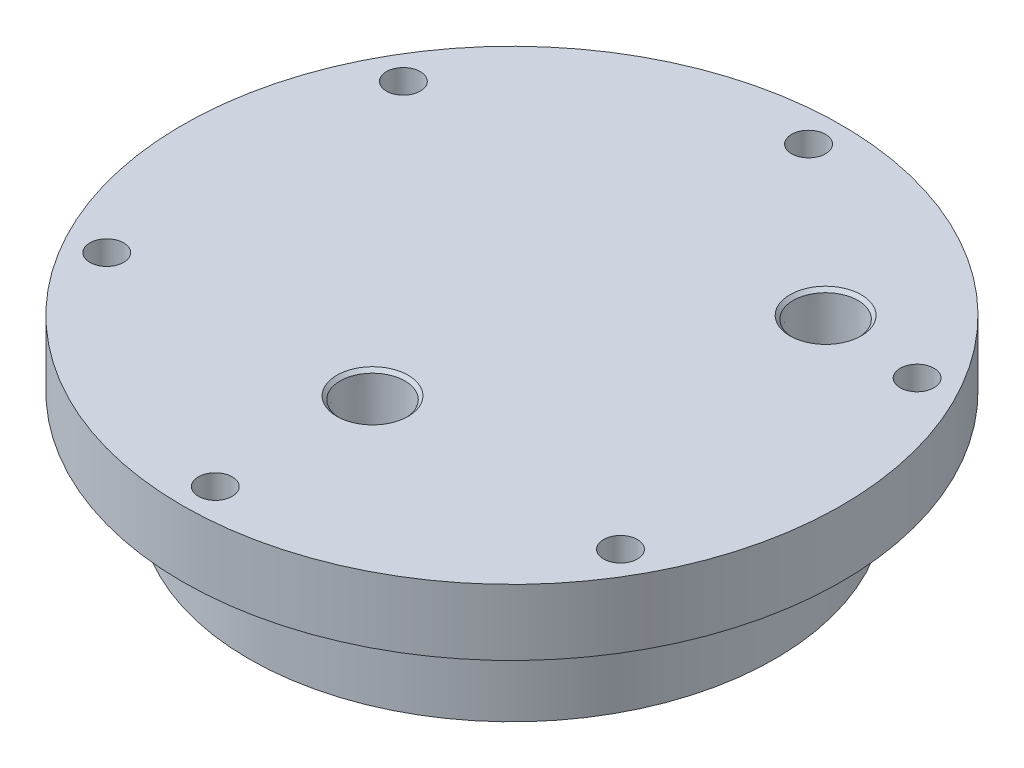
from build123d import *

# Parameters (mm, degrees)
F_5_16_18_TAPPED_HOLE1_D          = 6.5278
CIRPATTERN1_COUNT                 = 6
SKETCH5_W                         = 12.7
SKETCH5_H                         = 15.875
F_1_4_NPT_TAPPED_HOLE1_AT_2_COUNT = 2
F_1_4_NPT_TAPPED_HOLE1_AT_2_PITCH = 64.584679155


with BuildPart() as part:
    # Sketch1 → Revolve1 (revolve)
    with BuildSketch(Plane.XY, mode=Mode.PRIVATE) as revolve1_sk:
        Polygon((0, 0), (50.673, 0), (50.673, 19.304), (63.5, 19.304), (63.5, 32.004), (0, 32.004), align=None)
    revolve(revolve1_sk.sketch.rotate(Axis((0, 0, 0), (0, -1, 0)), 90), axis=Axis((0, 0, 0), (0, -1, 0)))

    # 5_16-18 Tapped Hole1 (through all)
    with Locations(Plane.XZ.offset(-19.304)):
        with Locations((0, 57.15)):
            f_5_16_18_tapped_hole1 = Hole(F_5_16_18_TAPPED_HOLE1_D / 2)

    # CirPattern1: 5_16-18 Tapped Hole1 ×6 about axis
    cirpattern1_axis = Axis((0, 0, 0), (0, 1, 0))
    for i in range(1, CIRPATTERN1_COUNT):
        add(f_5_16_18_tapped_hole1.rotate(cirpattern1_axis, i * 360 / CIRPATTERN1_COUNT), mode=Mode.SUBTRACT)

    # Sketch5 → Cut-Revolve1 (revolve, cut)
    with BuildSketch(Plane.XY, mode=Mode.PRIVATE) as cut_revolve1_sk:
        with Locations((26.8605, 7.9375)):
            Rectangle(SKETCH5_W, SKETCH5_H)
        with Locations((42.7355, 7.9375)):
            Rectangle(SKETCH5_W, SKETCH5_H)
    revolve(cut_revolve1_sk.sketch.rotate(Axis((0, 0, 0), (0, 1, 0)), 90), axis=Axis((0, 0, 0), (0, 1, 0)), mode=Mode.SUBTRACT)

    # Sketch7 → 1_4 NPT Tapped Hole1 (revolve, cut)
    with BuildSketch(Plane(origin=(0, 32.004, 26.8605), x_dir=(0, 0, 1), z_dir=(1, 0, 0))):
        Polygon((0, 0), (0, 16.129), (5.5626, 16.129), (5.5626, 9.906), (5.962698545, 9.906), (6.2402847, 0.635), (6.8752847, 0), align=None)
    f_1_4_npt_tapped_hole1 = revolve(axis=Axis((0, 38.354, 26.8605), (0, -1, 0)), mode=Mode.SUBTRACT)

    # 1_4 NPT Tapped Hole1 at 2: 1_4 NPT Tapped Hole1 ×2
    with Locations(*[Vector(0.46789056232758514, 0, -0.8837864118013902) * (i * F_1_4_NPT_TAPPED_HOLE1_AT_2_PITCH) for i in range(1, F_1_4_NPT_TAPPED_HOLE1_AT_2_COUNT)]):
        add(f_1_4_npt_tapped_hole1, mode=Mode.SUBTRACT)


solid = part.part
